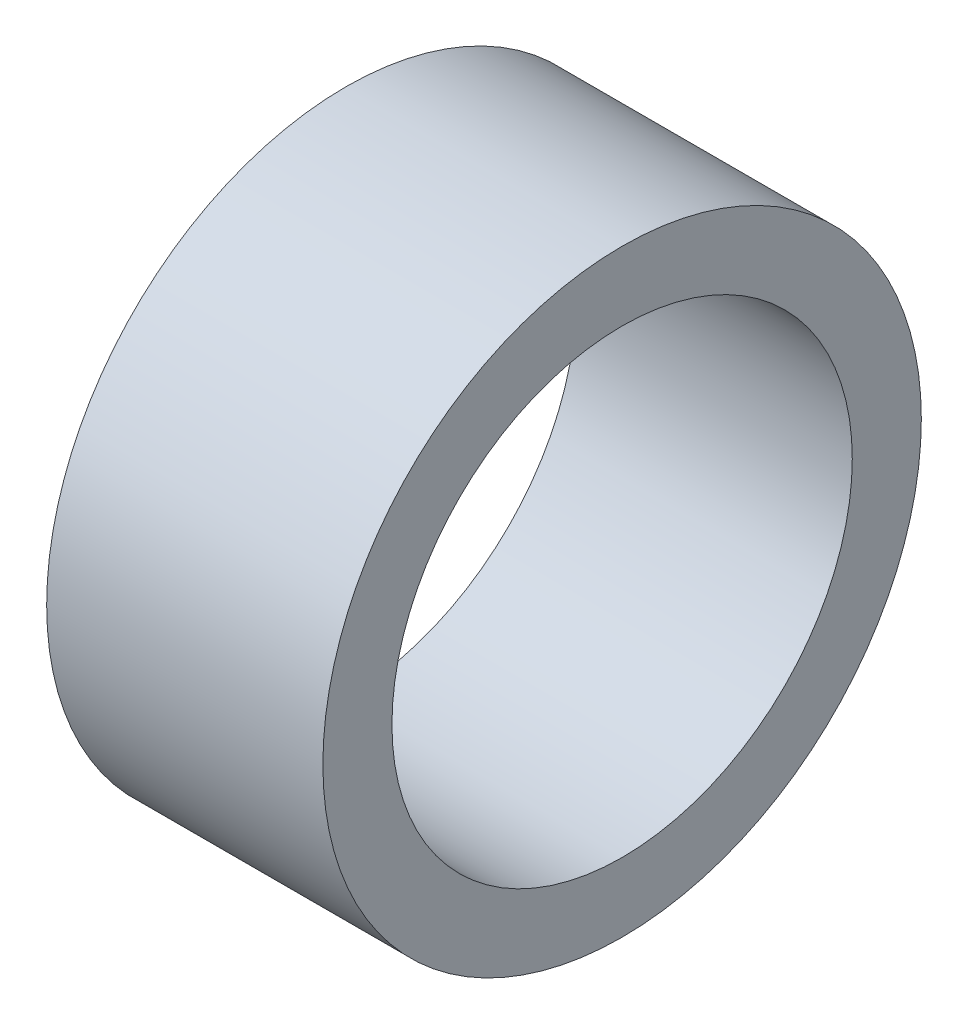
ISO-10303-21;
HEADER;
FILE_DESCRIPTION(('STEP AP214'),'2;1');
FILE_NAME('part.step','',(''),(''),'','','');
FILE_SCHEMA(('AUTOMOTIVE_DESIGN { 1 0 10303 214 1 1 1 1 }'));
ENDSEC;
DATA;
#1=APPLICATION_CONTEXT('core data for automotive mechanical design processes');
#2=APPLICATION_PROTOCOL_DEFINITION('international standard','automotive_design',2000,#1);
#3=PRODUCT_CONTEXT('',#1,'mechanical');
#4=PRODUCT('Part','Part','',(#3));
#5=PRODUCT_RELATED_PRODUCT_CATEGORY('part','',(#4));
#6=PRODUCT_DEFINITION_FORMATION('','',#4);
#7=PRODUCT_DEFINITION_CONTEXT('part definition',#1,'design');
#8=PRODUCT_DEFINITION('design','',#6,#7);
#9=PRODUCT_DEFINITION_SHAPE('','',#8);
#10=(LENGTH_UNIT() NAMED_UNIT(*) SI_UNIT(.MILLI.,.METRE.));
#11=(NAMED_UNIT(*) PLANE_ANGLE_UNIT() SI_UNIT($,.RADIAN.));
#12=(NAMED_UNIT(*) SI_UNIT($,.STERADIAN.) SOLID_ANGLE_UNIT());
#13=UNCERTAINTY_MEASURE_WITH_UNIT(LENGTH_MEASURE(1.E-05),#10,'distance_accuracy_value','');
#14=(GEOMETRIC_REPRESENTATION_CONTEXT(3) GLOBAL_UNCERTAINTY_ASSIGNED_CONTEXT((#13)) GLOBAL_UNIT_ASSIGNED_CONTEXT((#10,
#11,#12)) REPRESENTATION_CONTEXT('',''));
#15=CARTESIAN_POINT('',(0.,0.,0.));
#16=DIRECTION('',(0.,0.,1.));
#17=DIRECTION('',(1.,0.,0.));
#18=AXIS2_PLACEMENT_3D('',#15,#16,#17);
#19=CARTESIAN_POINT('',(-25.1,0.,0.));
#20=DIRECTION('',(-1.,0.,0.));
#21=DIRECTION('',(0.,0.,1.));
#22=AXIS2_PLACEMENT_3D('',#19,#20,#21);
#23=CYLINDRICAL_SURFACE('',#22,2.5);
#24=CARTESIAN_POINT('',(-23.6,0.,0.));
#25=DIRECTION('',(-1.,0.,0.));
#26=DIRECTION('',(0.,0.,1.));
#27=AXIS2_PLACEMENT_3D('',#24,#25,#26);
#28=CIRCLE('',#27,2.5);
#29=CARTESIAN_POINT('',(-23.6,0.,2.5));
#30=VERTEX_POINT('',#29);
#31=EDGE_CURVE('E18',#30,#30,#28,.F.);
#32=ORIENTED_EDGE('',*,*,#31,.T.);
#33=EDGE_LOOP('',(#32));
#34=FACE_BOUND('',#33,.T.);
#35=CARTESIAN_POINT('',(-26.6,0.,0.));
#36=DIRECTION('',(-1.,0.,0.));
#37=DIRECTION('',(0.,0.,1.));
#38=AXIS2_PLACEMENT_3D('',#35,#36,#37);
#39=CIRCLE('',#38,2.5);
#40=CARTESIAN_POINT('',(-26.6,0.,2.50000000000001));
#41=VERTEX_POINT('',#40);
#42=EDGE_CURVE('E27',#41,#41,#39,.F.);
#43=ORIENTED_EDGE('',*,*,#42,.F.);
#44=EDGE_LOOP('',(#43));
#45=FACE_BOUND('',#44,.T.);
#46=ADVANCED_FACE('F15',(#34,#45),#23,.F.);
#47=CARTESIAN_POINT('',(-23.6,0.,0.));
#48=DIRECTION('',(-1.,0.,0.));
#49=DIRECTION('',(0.,0.,1.));
#50=AXIS2_PLACEMENT_3D('',#47,#48,#49);
#51=PLANE('',#50);
#52=ORIENTED_EDGE('',*,*,#31,.F.);
#53=EDGE_LOOP('',(#52));
#54=FACE_BOUND('',#53,.T.);
#55=CARTESIAN_POINT('',(-23.6,0.,0.));
#56=DIRECTION('',(-1.,0.,0.));
#57=DIRECTION('',(0.,0.,1.));
#58=AXIS2_PLACEMENT_3D('',#55,#56,#57);
#59=CIRCLE('',#58,3.25);
#60=CARTESIAN_POINT('',(-23.6,0.,3.25));
#61=VERTEX_POINT('',#60);
#62=EDGE_CURVE('E22',#61,#61,#59,.T.);
#63=ORIENTED_EDGE('',*,*,#62,.F.);
#64=EDGE_LOOP('',(#63));
#65=FACE_BOUND('',#64,.T.);
#66=ADVANCED_FACE('F37',(#54,#65),#51,.F.);
#67=CARTESIAN_POINT('',(-26.6,0.,0.));
#68=DIRECTION('',(-1.,0.,0.));
#69=DIRECTION('',(0.,0.,1.));
#70=AXIS2_PLACEMENT_3D('',#67,#68,#69);
#71=PLANE('',#70);
#72=ORIENTED_EDGE('',*,*,#42,.T.);
#73=EDGE_LOOP('',(#72));
#74=FACE_BOUND('',#73,.T.);
#75=CARTESIAN_POINT('',(-26.6,0.,0.));
#76=DIRECTION('',(-1.,0.,0.));
#77=DIRECTION('',(0.,0.,1.));
#78=AXIS2_PLACEMENT_3D('',#75,#76,#77);
#79=CIRCLE('',#78,3.25);
#80=CARTESIAN_POINT('',(-26.6,0.,3.25000000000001));
#81=VERTEX_POINT('',#80);
#82=EDGE_CURVE('E10',#81,#81,#79,.F.);
#83=ORIENTED_EDGE('',*,*,#82,.F.);
#84=EDGE_LOOP('',(#83));
#85=FACE_BOUND('',#84,.T.);
#86=ADVANCED_FACE('F40',(#74,#85),#71,.T.);
#87=CARTESIAN_POINT('',(-25.1,0.,0.));
#88=DIRECTION('',(-1.,0.,0.));
#89=DIRECTION('',(0.,0.,1.));
#90=AXIS2_PLACEMENT_3D('',#87,#88,#89);
#91=CYLINDRICAL_SURFACE('',#90,3.25);
#92=ORIENTED_EDGE('',*,*,#62,.T.);
#93=EDGE_LOOP('',(#92));
#94=FACE_BOUND('',#93,.T.);
#95=ORIENTED_EDGE('',*,*,#82,.T.);
#96=EDGE_LOOP('',(#95));
#97=FACE_BOUND('',#96,.T.);
#98=ADVANCED_FACE('F43',(#94,#97),#91,.T.);
#99=CLOSED_SHELL('',(#46,#66,#86,#98));
#100=MANIFOLD_SOLID_BREP('B1',#99);
#101=ADVANCED_BREP_SHAPE_REPRESENTATION('',(#18,#100),#14);
#102=SHAPE_DEFINITION_REPRESENTATION(#9,#101);
ENDSEC;
END-ISO-10303-21;
